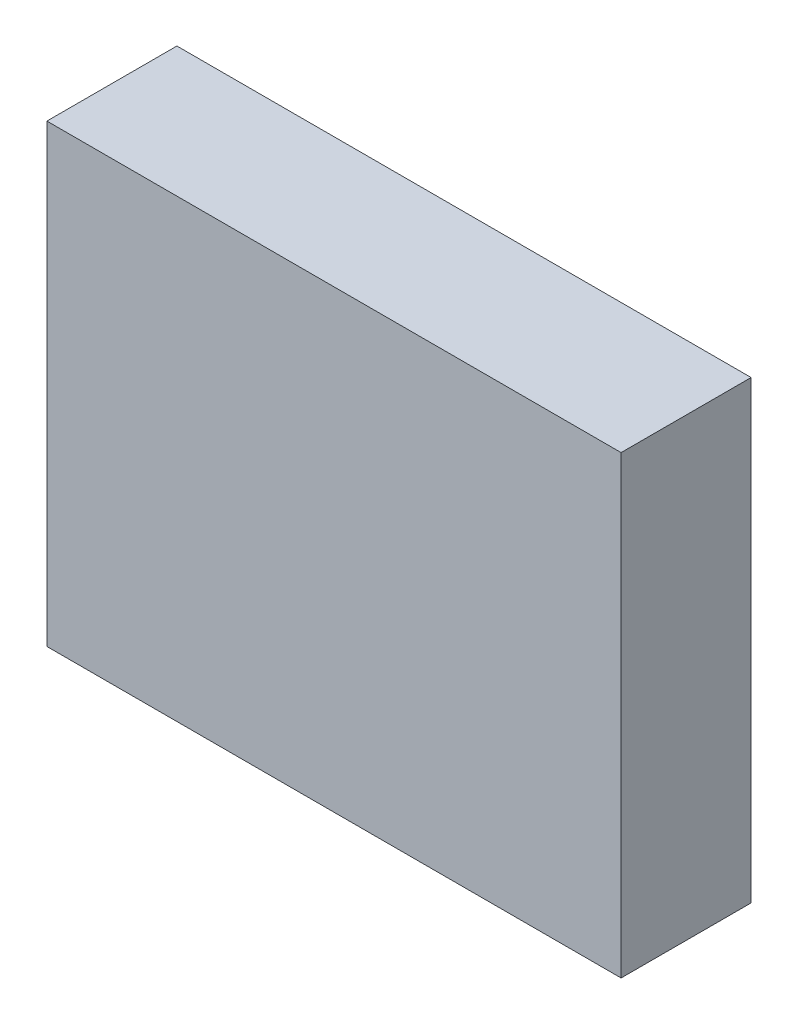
from build123d import *

# Parameters (mm, degrees)
SKETCH1_W           = 106
SKETCH1_H           = 84
BOSS_EXTRUDE1_DEPTH = 24


with BuildPart() as part:
    # Sketch1 → Boss-Extrude1 (new body)
    with BuildSketch(Plane.XY):
        with Locations((-9.051546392, -12.231958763)):
            Rectangle(SKETCH1_W, SKETCH1_H)
    extrude(amount=BOSS_EXTRUDE1_DEPTH)


solid = part.part
